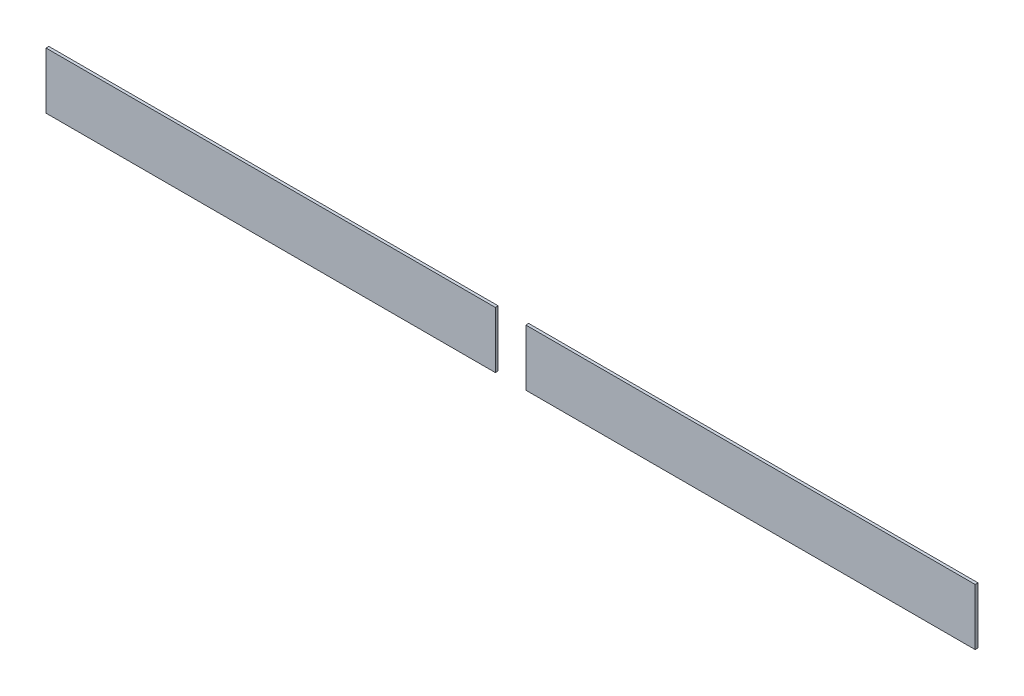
ISO-10303-21;
HEADER;
FILE_DESCRIPTION(('STEP AP214'),'2;1');
FILE_NAME('part.step','',(''),(''),'','','');
FILE_SCHEMA(('AUTOMOTIVE_DESIGN { 1 0 10303 214 1 1 1 1 }'));
ENDSEC;
DATA;
#1=APPLICATION_CONTEXT('core data for automotive mechanical design processes');
#2=APPLICATION_PROTOCOL_DEFINITION('international standard','automotive_design',2000,#1);
#3=PRODUCT_CONTEXT('',#1,'mechanical');
#4=PRODUCT('Part','Part','',(#3));
#5=PRODUCT_RELATED_PRODUCT_CATEGORY('part','',(#4));
#6=PRODUCT_DEFINITION_FORMATION('','',#4);
#7=PRODUCT_DEFINITION_CONTEXT('part definition',#1,'design');
#8=PRODUCT_DEFINITION('design','',#6,#7);
#9=PRODUCT_DEFINITION_SHAPE('','',#8);
#10=(LENGTH_UNIT() NAMED_UNIT(*) SI_UNIT(.MILLI.,.METRE.));
#11=(NAMED_UNIT(*) PLANE_ANGLE_UNIT() SI_UNIT($,.RADIAN.));
#12=(NAMED_UNIT(*) SI_UNIT($,.STERADIAN.) SOLID_ANGLE_UNIT());
#13=UNCERTAINTY_MEASURE_WITH_UNIT(LENGTH_MEASURE(1.E-05),#10,'distance_accuracy_value','');
#14=(GEOMETRIC_REPRESENTATION_CONTEXT(3) GLOBAL_UNCERTAINTY_ASSIGNED_CONTEXT((#13)) GLOBAL_UNIT_ASSIGNED_CONTEXT((#10,
#11,#12)) REPRESENTATION_CONTEXT('',''));
#15=CARTESIAN_POINT('',(0.,0.,0.));
#16=DIRECTION('',(0.,0.,1.));
#17=DIRECTION('',(1.,0.,0.));
#18=AXIS2_PLACEMENT_3D('',#15,#16,#17);
#19=CARTESIAN_POINT('',(850.,50.,0.));
#20=DIRECTION('',(0.,-1.,0.));
#21=DIRECTION('',(0.,0.,-1.));
#22=AXIS2_PLACEMENT_3D('',#19,#20,#21);
#23=PLANE('',#22);
#24=DIRECTION('',(0.,0.,-1.));
#25=VECTOR('',#24,1.);
#26=CARTESIAN_POINT('',(-823.,50.,12.5));
#27=LINE('',#26,#25);
#28=CARTESIAN_POINT('',(-823.,50.,5.));
#29=VERTEX_POINT('',#28);
#30=CARTESIAN_POINT('',(-823.,50.,0.));
#31=VERTEX_POINT('',#30);
#32=EDGE_CURVE('P0_E11',#29,#31,#27,.T.);
#33=ORIENTED_EDGE('',*,*,#32,.F.);
#34=DIRECTION('',(-1.,0.,0.));
#35=VECTOR('',#34,1.);
#36=CARTESIAN_POINT('',(850.,50.,5.));
#37=LINE('',#36,#35);
#38=CARTESIAN_POINT('',(-27.,50.,5.));
#39=VERTEX_POINT('',#38);
#40=EDGE_CURVE('P0_E42',#39,#29,#37,.T.);
#41=ORIENTED_EDGE('',*,*,#40,.F.);
#42=DIRECTION('',(0.,0.,1.));
#43=VECTOR('',#42,1.);
#44=CARTESIAN_POINT('',(-27.,50.,-12.5));
#45=LINE('',#44,#43);
#46=CARTESIAN_POINT('',(-27.,50.,0.));
#47=VERTEX_POINT('',#46);
#48=EDGE_CURVE('P0_E75',#47,#39,#45,.T.);
#49=ORIENTED_EDGE('',*,*,#48,.F.);
#50=DIRECTION('',(-1.,0.,0.));
#51=VECTOR('',#50,1.);
#52=CARTESIAN_POINT('',(850.,50.,0.));
#53=LINE('',#52,#51);
#54=EDGE_CURVE('P0_E78',#47,#31,#53,.T.);
#55=ORIENTED_EDGE('',*,*,#54,.T.);
#56=EDGE_LOOP('',(#33,#41,#49,#55));
#57=FACE_BOUND('',#56,.T.);
#58=ADVANCED_FACE('P0_F17',(#57),#23,.F.);
#59=CARTESIAN_POINT('',(-823.,-60.,25.));
#60=DIRECTION('',(-1.,0.,0.));
#61=DIRECTION('',(0.,0.,1.));
#62=AXIS2_PLACEMENT_3D('',#59,#60,#61);
#63=PLANE('',#62);
#64=DIRECTION('',(0.,-1.,0.));
#65=VECTOR('',#64,1.);
#66=CARTESIAN_POINT('',(-823.,-30.,0.));
#67=LINE('',#66,#65);
#68=CARTESIAN_POINT('',(-823.,-50.,0.));
#69=VERTEX_POINT('',#68);
#70=EDGE_CURVE('P0_E99',#31,#69,#67,.T.);
#71=ORIENTED_EDGE('',*,*,#70,.T.);
#72=DIRECTION('',(0.,0.,1.));
#73=VECTOR('',#72,1.);
#74=CARTESIAN_POINT('',(-823.,-50.,12.5));
#75=LINE('',#74,#73);
#76=CARTESIAN_POINT('',(-823.,-50.,5.));
#77=VERTEX_POINT('',#76);
#78=EDGE_CURVE('P0_E87',#69,#77,#75,.T.);
#79=ORIENTED_EDGE('',*,*,#78,.T.);
#80=DIRECTION('',(0.,-1.,0.));
#81=VECTOR('',#80,1.);
#82=CARTESIAN_POINT('',(-823.,-30.,5.));
#83=LINE('',#82,#81);
#84=EDGE_CURVE('P0_E25',#29,#77,#83,.T.);
#85=ORIENTED_EDGE('',*,*,#84,.F.);
#86=ORIENTED_EDGE('',*,*,#32,.T.);
#87=EDGE_LOOP('',(#71,#79,#85,#86));
#88=FACE_BOUND('',#87,.T.);
#89=ADVANCED_FACE('P0_F147',(#88),#63,.T.);
#90=CARTESIAN_POINT('',(0.,0.,5.));
#91=DIRECTION('',(0.,0.,1.));
#92=DIRECTION('',(1.,0.,0.));
#93=AXIS2_PLACEMENT_3D('',#90,#91,#92);
#94=PLANE('',#93);
#95=ORIENTED_EDGE('',*,*,#40,.T.);
#96=ORIENTED_EDGE('',*,*,#84,.T.);
#97=DIRECTION('',(1.,0.,0.));
#98=VECTOR('',#97,1.);
#99=CARTESIAN_POINT('',(-850.,-50.,5.));
#100=LINE('',#99,#98);
#101=CARTESIAN_POINT('',(-27.,-50.,5.));
#102=VERTEX_POINT('',#101);
#103=EDGE_CURVE('P0_E81',#77,#102,#100,.T.);
#104=ORIENTED_EDGE('',*,*,#103,.T.);
#105=DIRECTION('',(0.,1.,0.));
#106=VECTOR('',#105,1.);
#107=CARTESIAN_POINT('',(-27.,-30.,5.));
#108=LINE('',#107,#106);
#109=EDGE_CURVE('P0_E69',#102,#39,#108,.T.);
#110=ORIENTED_EDGE('',*,*,#109,.T.);
#111=EDGE_LOOP('',(#95,#96,#104,#110));
#112=FACE_BOUND('',#111,.T.);
#113=ADVANCED_FACE('P0_F82',(#112),#94,.T.);
#114=CARTESIAN_POINT('',(-27.,-60.,-25.));
#115=DIRECTION('',(1.,0.,0.));
#116=DIRECTION('',(0.,1.,0.));
#117=AXIS2_PLACEMENT_3D('',#114,#115,#116);
#118=PLANE('',#117);
#119=ORIENTED_EDGE('',*,*,#109,.F.);
#120=DIRECTION('',(0.,0.,-1.));
#121=VECTOR('',#120,1.);
#122=CARTESIAN_POINT('',(-27.,-50.,-12.5));
#123=LINE('',#122,#121);
#124=CARTESIAN_POINT('',(-27.,-50.,0.));
#125=VERTEX_POINT('',#124);
#126=EDGE_CURVE('P0_E74',#102,#125,#123,.T.);
#127=ORIENTED_EDGE('',*,*,#126,.T.);
#128=DIRECTION('',(0.,1.,0.));
#129=VECTOR('',#128,1.);
#130=CARTESIAN_POINT('',(-27.,-30.,0.));
#131=LINE('',#130,#129);
#132=EDGE_CURVE('P0_E102',#125,#47,#131,.T.);
#133=ORIENTED_EDGE('',*,*,#132,.T.);
#134=ORIENTED_EDGE('',*,*,#48,.T.);
#135=EDGE_LOOP('',(#119,#127,#133,#134));
#136=FACE_BOUND('',#135,.T.);
#137=ADVANCED_FACE('P0_F71',(#136),#118,.T.);
#138=CARTESIAN_POINT('',(0.,0.,0.));
#139=DIRECTION('',(0.,0.,1.));
#140=DIRECTION('',(1.,0.,0.));
#141=AXIS2_PLACEMENT_3D('',#138,#139,#140);
#142=PLANE('',#141);
#143=ORIENTED_EDGE('',*,*,#132,.F.);
#144=DIRECTION('',(1.,0.,0.));
#145=VECTOR('',#144,1.);
#146=CARTESIAN_POINT('',(-850.,-50.,0.));
#147=LINE('',#146,#145);
#148=EDGE_CURVE('P0_E92',#69,#125,#147,.T.);
#149=ORIENTED_EDGE('',*,*,#148,.F.);
#150=ORIENTED_EDGE('',*,*,#70,.F.);
#151=ORIENTED_EDGE('',*,*,#54,.F.);
#152=EDGE_LOOP('',(#143,#149,#150,#151));
#153=FACE_BOUND('',#152,.T.);
#154=ADVANCED_FACE('P0_F123',(#153),#142,.F.);
#155=CARTESIAN_POINT('',(-850.,-50.,0.));
#156=DIRECTION('',(0.,1.,0.));
#157=DIRECTION('',(1.,0.,0.));
#158=AXIS2_PLACEMENT_3D('',#155,#156,#157);
#159=PLANE('',#158);
#160=ORIENTED_EDGE('',*,*,#126,.F.);
#161=ORIENTED_EDGE('',*,*,#103,.F.);
#162=ORIENTED_EDGE('',*,*,#78,.F.);
#163=ORIENTED_EDGE('',*,*,#148,.T.);
#164=EDGE_LOOP('',(#160,#161,#162,#163));
#165=FACE_BOUND('',#164,.T.);
#166=ADVANCED_FACE('P0_F90',(#165),#159,.F.);
#167=CLOSED_SHELL('',(#58,#89,#113,#137,#154,#166));
#168=MANIFOLD_SOLID_BREP('P0_B1',#167);
#169=CARTESIAN_POINT('',(850.,50.,0.));
#170=DIRECTION('',(0.,-1.,0.));
#171=DIRECTION('',(0.,0.,-1.));
#172=AXIS2_PLACEMENT_3D('',#169,#170,#171);
#173=PLANE('',#172);
#174=DIRECTION('',(0.,0.,-1.));
#175=VECTOR('',#174,1.);
#176=CARTESIAN_POINT('',(27.,50.,12.5));
#177=LINE('',#176,#175);
#178=CARTESIAN_POINT('',(27.,50.,5.));
#179=VERTEX_POINT('',#178);
#180=CARTESIAN_POINT('',(27.,50.,0.));
#181=VERTEX_POINT('',#180);
#182=EDGE_CURVE('P1_E10',#179,#181,#177,.T.);
#183=ORIENTED_EDGE('',*,*,#182,.F.);
#184=DIRECTION('',(-1.,0.,0.));
#185=VECTOR('',#184,1.);
#186=CARTESIAN_POINT('',(850.,50.,5.));
#187=LINE('',#186,#185);
#188=CARTESIAN_POINT('',(823.,50.,5.));
#189=VERTEX_POINT('',#188);
#190=EDGE_CURVE('P1_E45',#189,#179,#187,.T.);
#191=ORIENTED_EDGE('',*,*,#190,.F.);
#192=DIRECTION('',(0.,0.,1.));
#193=VECTOR('',#192,1.);
#194=CARTESIAN_POINT('',(823.,50.,-12.5));
#195=LINE('',#194,#193);
#196=CARTESIAN_POINT('',(823.,50.,0.));
#197=VERTEX_POINT('',#196);
#198=EDGE_CURVE('P1_E66',#197,#189,#195,.T.);
#199=ORIENTED_EDGE('',*,*,#198,.F.);
#200=DIRECTION('',(-1.,0.,0.));
#201=VECTOR('',#200,1.);
#202=CARTESIAN_POINT('',(850.,50.,0.));
#203=LINE('',#202,#201);
#204=EDGE_CURVE('P1_E65',#197,#181,#203,.T.);
#205=ORIENTED_EDGE('',*,*,#204,.T.);
#206=EDGE_LOOP('',(#183,#191,#199,#205));
#207=FACE_BOUND('',#206,.T.);
#208=ADVANCED_FACE('P1_F16',(#207),#173,.F.);
#209=CARTESIAN_POINT('',(27.,-60.,25.));
#210=DIRECTION('',(-1.,0.,0.));
#211=DIRECTION('',(0.,0.,1.));
#212=AXIS2_PLACEMENT_3D('',#209,#210,#211);
#213=PLANE('',#212);
#214=DIRECTION('',(0.,-1.,0.));
#215=VECTOR('',#214,1.);
#216=CARTESIAN_POINT('',(27.,-30.,0.));
#217=LINE('',#216,#215);
#218=CARTESIAN_POINT('',(27.,-50.,0.));
#219=VERTEX_POINT('',#218);
#220=EDGE_CURVE('P1_E61',#181,#219,#217,.T.);
#221=ORIENTED_EDGE('',*,*,#220,.T.);
#222=DIRECTION('',(0.,0.,1.));
#223=VECTOR('',#222,1.);
#224=CARTESIAN_POINT('',(27.,-50.,12.5));
#225=LINE('',#224,#223);
#226=CARTESIAN_POINT('',(27.,-50.,5.));
#227=VERTEX_POINT('',#226);
#228=EDGE_CURVE('P1_E81',#219,#227,#225,.T.);
#229=ORIENTED_EDGE('',*,*,#228,.T.);
#230=DIRECTION('',(0.,-1.,0.));
#231=VECTOR('',#230,1.);
#232=CARTESIAN_POINT('',(27.,-30.,5.));
#233=LINE('',#232,#231);
#234=EDGE_CURVE('P1_E25',#179,#227,#233,.T.);
#235=ORIENTED_EDGE('',*,*,#234,.F.);
#236=ORIENTED_EDGE('',*,*,#182,.T.);
#237=EDGE_LOOP('',(#221,#229,#235,#236));
#238=FACE_BOUND('',#237,.T.);
#239=ADVANCED_FACE('P1_F58',(#238),#213,.T.);
#240=CARTESIAN_POINT('',(0.,0.,5.));
#241=DIRECTION('',(0.,0.,1.));
#242=DIRECTION('',(1.,0.,0.));
#243=AXIS2_PLACEMENT_3D('',#240,#241,#242);
#244=PLANE('',#243);
#245=DIRECTION('',(0.,1.,0.));
#246=VECTOR('',#245,1.);
#247=CARTESIAN_POINT('',(823.,-30.,5.));
#248=LINE('',#247,#246);
#249=CARTESIAN_POINT('',(823.,-50.,5.));
#250=VERTEX_POINT('',#249);
#251=EDGE_CURVE('P1_E87',#250,#189,#248,.T.);
#252=ORIENTED_EDGE('',*,*,#251,.T.);
#253=ORIENTED_EDGE('',*,*,#190,.T.);
#254=ORIENTED_EDGE('',*,*,#234,.T.);
#255=DIRECTION('',(1.,0.,0.));
#256=VECTOR('',#255,1.);
#257=CARTESIAN_POINT('',(-850.,-50.,5.));
#258=LINE('',#257,#256);
#259=EDGE_CURVE('P1_E99',#227,#250,#258,.T.);
#260=ORIENTED_EDGE('',*,*,#259,.T.);
#261=EDGE_LOOP('',(#252,#253,#254,#260));
#262=FACE_BOUND('',#261,.T.);
#263=ADVANCED_FACE('P1_F109',(#262),#244,.T.);
#264=CARTESIAN_POINT('',(823.,-60.,-25.));
#265=DIRECTION('',(1.,0.,0.));
#266=DIRECTION('',(0.,1.,0.));
#267=AXIS2_PLACEMENT_3D('',#264,#265,#266);
#268=PLANE('',#267);
#269=ORIENTED_EDGE('',*,*,#251,.F.);
#270=DIRECTION('',(0.,0.,-1.));
#271=VECTOR('',#270,1.);
#272=CARTESIAN_POINT('',(823.,-50.,-12.5));
#273=LINE('',#272,#271);
#274=CARTESIAN_POINT('',(823.,-50.,0.));
#275=VERTEX_POINT('',#274);
#276=EDGE_CURVE('P1_E102',#250,#275,#273,.T.);
#277=ORIENTED_EDGE('',*,*,#276,.T.);
#278=DIRECTION('',(0.,1.,0.));
#279=VECTOR('',#278,1.);
#280=CARTESIAN_POINT('',(823.,-30.,0.));
#281=LINE('',#280,#279);
#282=EDGE_CURVE('P1_E71',#275,#197,#281,.T.);
#283=ORIENTED_EDGE('',*,*,#282,.T.);
#284=ORIENTED_EDGE('',*,*,#198,.T.);
#285=EDGE_LOOP('',(#269,#277,#283,#284));
#286=FACE_BOUND('',#285,.T.);
#287=ADVANCED_FACE('P1_F18',(#286),#268,.T.);
#288=CARTESIAN_POINT('',(0.,0.,0.));
#289=DIRECTION('',(0.,0.,1.));
#290=DIRECTION('',(1.,0.,0.));
#291=AXIS2_PLACEMENT_3D('',#288,#289,#290);
#292=PLANE('',#291);
#293=DIRECTION('',(1.,0.,0.));
#294=VECTOR('',#293,1.);
#295=CARTESIAN_POINT('',(-850.,-50.,0.));
#296=LINE('',#295,#294);
#297=EDGE_CURVE('P1_E75',#219,#275,#296,.T.);
#298=ORIENTED_EDGE('',*,*,#297,.F.);
#299=ORIENTED_EDGE('',*,*,#220,.F.);
#300=ORIENTED_EDGE('',*,*,#204,.F.);
#301=ORIENTED_EDGE('',*,*,#282,.F.);
#302=EDGE_LOOP('',(#298,#299,#300,#301));
#303=FACE_BOUND('',#302,.T.);
#304=ADVANCED_FACE('P1_F73',(#303),#292,.F.);
#305=CARTESIAN_POINT('',(-850.,-50.,0.));
#306=DIRECTION('',(0.,1.,0.));
#307=DIRECTION('',(1.,0.,0.));
#308=AXIS2_PLACEMENT_3D('',#305,#306,#307);
#309=PLANE('',#308);
#310=ORIENTED_EDGE('',*,*,#276,.F.);
#311=ORIENTED_EDGE('',*,*,#259,.F.);
#312=ORIENTED_EDGE('',*,*,#228,.F.);
#313=ORIENTED_EDGE('',*,*,#297,.T.);
#314=EDGE_LOOP('',(#310,#311,#312,#313));
#315=FACE_BOUND('',#314,.T.);
#316=ADVANCED_FACE('P1_F125',(#315),#309,.F.);
#317=CLOSED_SHELL('',(#208,#239,#263,#287,#304,#316));
#318=MANIFOLD_SOLID_BREP('P1_B1',#317);
#319=ADVANCED_BREP_SHAPE_REPRESENTATION('',(#18,#168,#318),#14);
#320=SHAPE_DEFINITION_REPRESENTATION(#9,#319);
ENDSEC;
END-ISO-10303-21;
